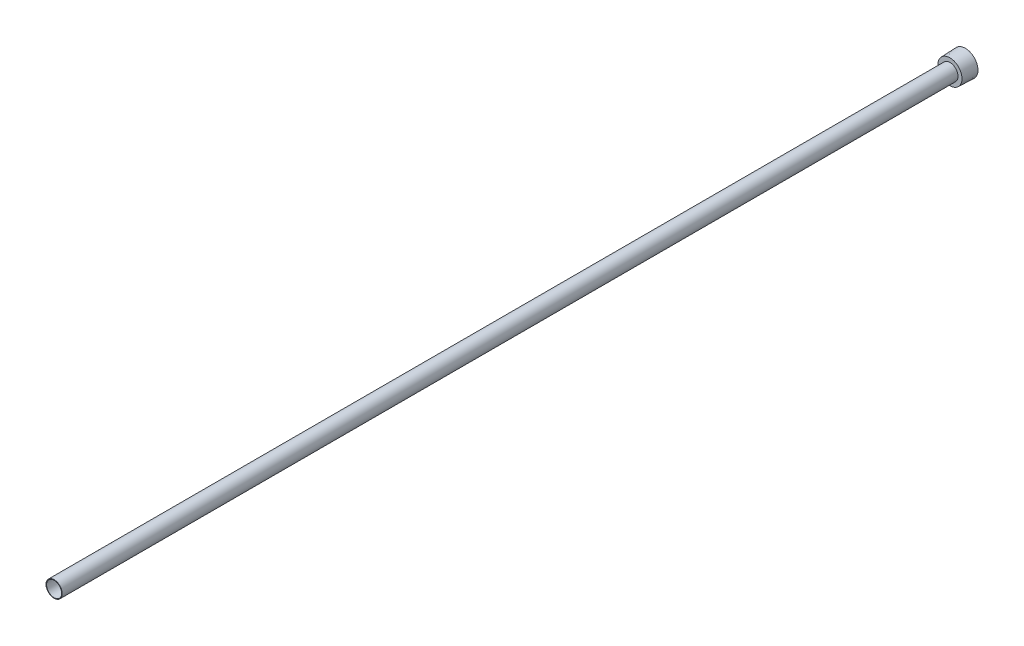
from build123d import *

# Parameters (mm, degrees)
SKETCH2_R          = 5.0419
CUT_EXTRUDE1_DEPTH = 610.717698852
CUT_EXTRUDE2_DEPTH = 6.35


with BuildPart() as part:
    # Sketch1 → Revolve1 (revolve)
    with BuildSketch(Plane(origin=(0, 0, 0), x_dir=(0, 0, -1), z_dir=(1, 0, 0)), mode=Mode.PRIVATE) as revolve1_sk:
        Polygon((0, 0), (0, 8.4709), (-10.3124, 8.094743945), (-10.3124, 5.4229), (-609.6, 5.4229), (-609.6, 0), align=None)
    revolve(revolve1_sk.sketch.rotate(Axis((0, 0, 168.793426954), (0, 0, -1)), 90), axis=Axis((0, 0, 168.793426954), (0, 0, -1)))

    # Sketch2 → Cut-Extrude1 (cut, through all)
    with BuildSketch(Plane.XY.offset(609.6)):
        Circle(SKETCH2_R)
    extrude(amount=-CUT_EXTRUDE1_DEPTH, mode=Mode.SUBTRACT)

    # Sketch3 → Cut-Extrude2 (cut)
    with BuildSketch(Plane(origin=(0, 0, 0), x_dir=(-1, 0, 0), z_dir=(0, 0, -1))):
        Polygon((0, -6.415804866), (5.55625, -3.207902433), (5.55625, 3.207902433), (0, 6.415804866), (-5.55625, 3.207902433), (-5.55625, -3.207902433), align=None)
    extrude(amount=-CUT_EXTRUDE2_DEPTH, mode=Mode.SUBTRACT)


solid = part.part
